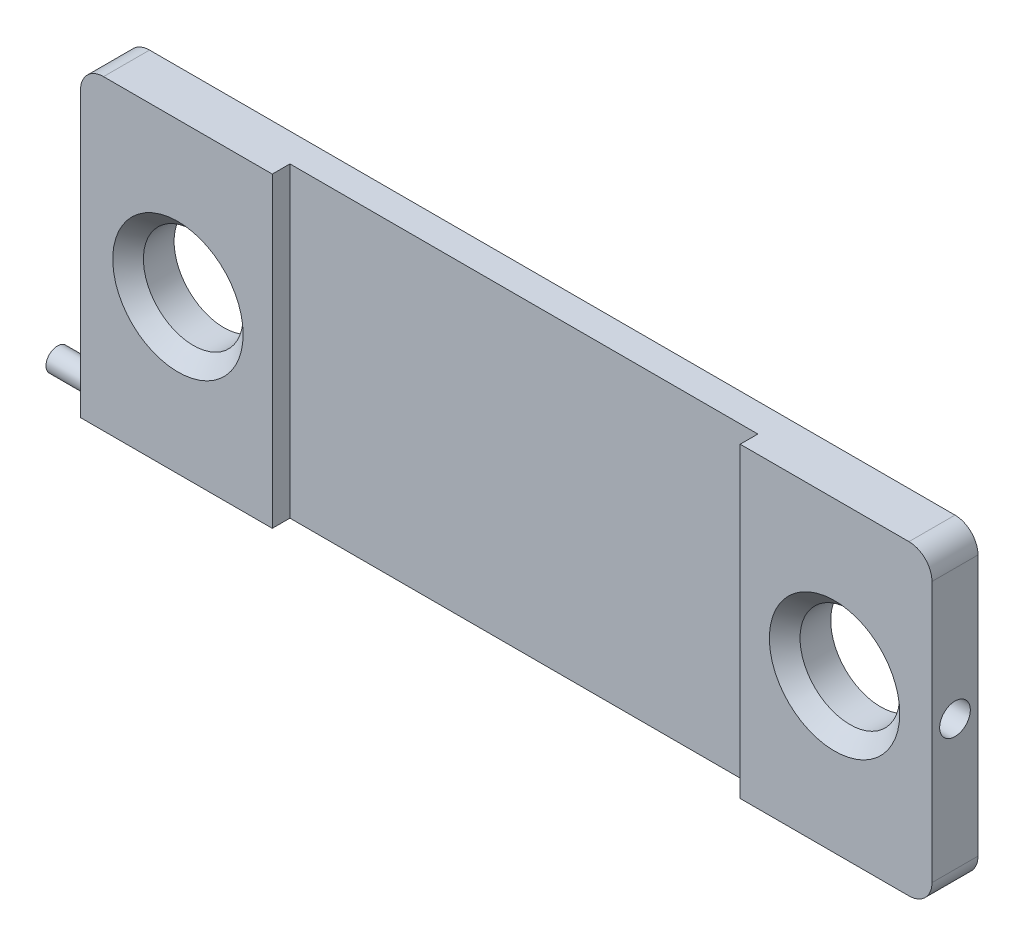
ISO-10303-21;
HEADER;
FILE_DESCRIPTION(('STEP AP214'),'2;1');
FILE_NAME('part.step','',(''),(''),'','','');
FILE_SCHEMA(('AUTOMOTIVE_DESIGN { 1 0 10303 214 1 1 1 1 }'));
ENDSEC;
DATA;
#1=APPLICATION_CONTEXT('core data for automotive mechanical design processes');
#2=APPLICATION_PROTOCOL_DEFINITION('international standard','automotive_design',2000,#1);
#3=PRODUCT_CONTEXT('',#1,'mechanical');
#4=PRODUCT('Part','Part','',(#3));
#5=PRODUCT_RELATED_PRODUCT_CATEGORY('part','',(#4));
#6=PRODUCT_DEFINITION_FORMATION('','',#4);
#7=PRODUCT_DEFINITION_CONTEXT('part definition',#1,'design');
#8=PRODUCT_DEFINITION('design','',#6,#7);
#9=PRODUCT_DEFINITION_SHAPE('','',#8);
#10=(LENGTH_UNIT() NAMED_UNIT(*) SI_UNIT(.MILLI.,.METRE.));
#11=(NAMED_UNIT(*) PLANE_ANGLE_UNIT() SI_UNIT($,.RADIAN.));
#12=(NAMED_UNIT(*) SI_UNIT($,.STERADIAN.) SOLID_ANGLE_UNIT());
#13=UNCERTAINTY_MEASURE_WITH_UNIT(LENGTH_MEASURE(1.E-05),#10,'distance_accuracy_value','');
#14=(GEOMETRIC_REPRESENTATION_CONTEXT(3) GLOBAL_UNCERTAINTY_ASSIGNED_CONTEXT((#13)) GLOBAL_UNIT_ASSIGNED_CONTEXT((#10,
#11,#12)) REPRESENTATION_CONTEXT('',''));
#15=CARTESIAN_POINT('',(0.,0.,0.));
#16=DIRECTION('',(0.,0.,1.));
#17=DIRECTION('',(1.,0.,0.));
#18=AXIS2_PLACEMENT_3D('',#15,#16,#17);
#19=CARTESIAN_POINT('',(-55.5,0.,3.));
#20=DIRECTION('',(1.,0.,0.));
#21=DIRECTION('',(0.,1.,0.));
#22=AXIS2_PLACEMENT_3D('',#19,#20,#21);
#23=PLANE('',#22);
#24=CARTESIAN_POINT('',(-55.5,-17.9,0.));
#25=DIRECTION('',(1.,0.,0.));
#26=DIRECTION('',(0.,1.,0.));
#27=AXIS2_PLACEMENT_3D('',#24,#25,#26);
#28=CIRCLE('',#27,1.5);
#29=CARTESIAN_POINT('',(-55.5,-16.4,0.));
#30=VERTEX_POINT('',#29);
#31=EDGE_CURVE('E12',#30,#30,#28,.F.);
#32=ORIENTED_EDGE('',*,*,#31,.F.);
#33=EDGE_LOOP('',(#32));
#34=FACE_BOUND('',#33,.T.);
#35=DIRECTION('',(0.,-1.,0.));
#36=VECTOR('',#35,1.);
#37=CARTESIAN_POINT('',(-55.5,0.,3.));
#38=LINE('',#37,#36);
#39=CARTESIAN_POINT('',(-55.5,17.,3.));
#40=VERTEX_POINT('',#39);
#41=CARTESIAN_POINT('',(-55.5,-20.,3.));
#42=VERTEX_POINT('',#41);
#43=EDGE_CURVE('E201',#40,#42,#38,.T.);
#44=ORIENTED_EDGE('',*,*,#43,.F.);
#45=DIRECTION('',(0.,0.,-1.));
#46=VECTOR('',#45,1.);
#47=CARTESIAN_POINT('',(-55.5,17.,-3.));
#48=LINE('',#47,#46);
#49=CARTESIAN_POINT('',(-55.5,17.,-3.));
#50=VERTEX_POINT('',#49);
#51=EDGE_CURVE('E250',#40,#50,#48,.T.);
#52=ORIENTED_EDGE('',*,*,#51,.T.);
#53=DIRECTION('',(0.,-1.,0.));
#54=VECTOR('',#53,1.);
#55=CARTESIAN_POINT('',(-55.5,0.,-3.));
#56=LINE('',#55,#54);
#57=CARTESIAN_POINT('',(-55.5,-20.,-3.));
#58=VERTEX_POINT('',#57);
#59=EDGE_CURVE('E219',#50,#58,#56,.T.);
#60=ORIENTED_EDGE('',*,*,#59,.T.);
#61=DIRECTION('',(0.,0.,-1.));
#62=VECTOR('',#61,1.);
#63=CARTESIAN_POINT('',(-55.5,-20.,3.));
#64=LINE('',#63,#62);
#65=EDGE_CURVE('E207',#42,#58,#64,.T.);
#66=ORIENTED_EDGE('',*,*,#65,.F.);
#67=EDGE_LOOP('',(#44,#52,#60,#66));
#68=FACE_BOUND('',#67,.T.);
#69=CARTESIAN_POINT('',(-55.5,0.,0.));
#70=DIRECTION('',(-1.,0.,0.));
#71=DIRECTION('',(0.,0.,1.));
#72=AXIS2_PLACEMENT_3D('',#69,#70,#71);
#73=CIRCLE('',#72,2.);
#74=CARTESIAN_POINT('',(-55.5,0.,2.));
#75=VERTEX_POINT('',#74);
#76=EDGE_CURVE('E164',#75,#75,#73,.T.);
#77=ORIENTED_EDGE('',*,*,#76,.F.);
#78=EDGE_LOOP('',(#77));
#79=FACE_BOUND('',#78,.T.);
#80=ADVANCED_FACE('F46',(#34,#68,#79),#23,.F.);
#81=CARTESIAN_POINT('',(0.,0.,3.));
#82=DIRECTION('',(0.,0.,1.));
#83=DIRECTION('',(1.,0.,0.));
#84=AXIS2_PLACEMENT_3D('',#81,#82,#83);
#85=PLANE('',#84);
#86=DIRECTION('',(0.,-1.,0.));
#87=VECTOR('',#86,1.);
#88=CARTESIAN_POINT('',(-30.5,20.,3.));
#89=LINE('',#88,#87);
#90=CARTESIAN_POINT('',(-30.5,20.,3.));
#91=VERTEX_POINT('',#90);
#92=CARTESIAN_POINT('',(-30.5,-20.,3.));
#93=VERTEX_POINT('',#92);
#94=EDGE_CURVE('E167',#91,#93,#89,.T.);
#95=ORIENTED_EDGE('',*,*,#94,.F.);
#96=DIRECTION('',(1.,0.,0.));
#97=VECTOR('',#96,1.);
#98=CARTESIAN_POINT('',(0.,20.,3.));
#99=LINE('',#98,#97);
#100=CARTESIAN_POINT('',(-52.5,20.,3.));
#101=VERTEX_POINT('',#100);
#102=EDGE_CURVE('E198',#101,#91,#99,.T.);
#103=ORIENTED_EDGE('',*,*,#102,.F.);
#104=CARTESIAN_POINT('',(-52.5,17.,3.));
#105=DIRECTION('',(0.,0.,1.));
#106=DIRECTION('',(1.,0.,0.));
#107=AXIS2_PLACEMENT_3D('',#104,#105,#106);
#108=CIRCLE('',#107,3.);
#109=EDGE_CURVE('E70',#101,#40,#108,.T.);
#110=ORIENTED_EDGE('',*,*,#109,.T.);
#111=ORIENTED_EDGE('',*,*,#43,.T.);
#112=DIRECTION('',(1.,0.,0.));
#113=VECTOR('',#112,1.);
#114=CARTESIAN_POINT('',(0.,-20.,3.));
#115=LINE('',#114,#113);
#116=EDGE_CURVE('E204',#42,#93,#115,.T.);
#117=ORIENTED_EDGE('',*,*,#116,.T.);
#118=EDGE_LOOP('',(#95,#103,#110,#111,#117));
#119=FACE_BOUND('',#118,.T.);
#120=CARTESIAN_POINT('',(-42.8,0.,3.));
#121=DIRECTION('',(0.,0.,1.));
#122=DIRECTION('',(1.,0.,0.));
#123=AXIS2_PLACEMENT_3D('',#120,#121,#122);
#124=CIRCLE('',#123,8.49999999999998);
#125=CARTESIAN_POINT('',(-34.3,0.,3.));
#126=VERTEX_POINT('',#125);
#127=EDGE_CURVE('E256',#126,#126,#124,.F.);
#128=ORIENTED_EDGE('',*,*,#127,.T.);
#129=EDGE_LOOP('',(#128));
#130=FACE_BOUND('',#129,.T.);
#131=ADVANCED_FACE('F294',(#119,#130),#85,.T.);
#132=CARTESIAN_POINT('',(55.5,0.,3.));
#133=DIRECTION('',(1.,0.,0.));
#134=DIRECTION('',(0.,1.,0.));
#135=AXIS2_PLACEMENT_3D('',#132,#133,#134);
#136=PLANE('',#135);
#137=CARTESIAN_POINT('',(55.5,0.,0.));
#138=DIRECTION('',(1.,0.,0.));
#139=DIRECTION('',(0.,0.,-1.));
#140=AXIS2_PLACEMENT_3D('',#137,#138,#139);
#141=CIRCLE('',#140,2.);
#142=CARTESIAN_POINT('',(55.5,0.,-2.));
#143=VERTEX_POINT('',#142);
#144=EDGE_CURVE('E153',#143,#143,#141,.T.);
#145=ORIENTED_EDGE('',*,*,#144,.F.);
#146=EDGE_LOOP('',(#145));
#147=FACE_BOUND('',#146,.T.);
#148=DIRECTION('',(0.,-1.,0.));
#149=VECTOR('',#148,1.);
#150=CARTESIAN_POINT('',(55.5,0.,3.));
#151=LINE('',#150,#149);
#152=CARTESIAN_POINT('',(55.5,17.,3.));
#153=VERTEX_POINT('',#152);
#154=CARTESIAN_POINT('',(55.5,-17.,3.));
#155=VERTEX_POINT('',#154);
#156=EDGE_CURVE('E193',#153,#155,#151,.T.);
#157=ORIENTED_EDGE('',*,*,#156,.T.);
#158=DIRECTION('',(0.,0.,-1.));
#159=VECTOR('',#158,1.);
#160=CARTESIAN_POINT('',(55.5,-17.,-3.));
#161=LINE('',#160,#159);
#162=CARTESIAN_POINT('',(55.5,-17.,-3.));
#163=VERTEX_POINT('',#162);
#164=EDGE_CURVE('E227',#155,#163,#161,.T.);
#165=ORIENTED_EDGE('',*,*,#164,.T.);
#166=DIRECTION('',(0.,-1.,0.));
#167=VECTOR('',#166,1.);
#168=CARTESIAN_POINT('',(55.5,0.,-3.));
#169=LINE('',#168,#167);
#170=CARTESIAN_POINT('',(55.5,17.,-3.));
#171=VERTEX_POINT('',#170);
#172=EDGE_CURVE('E213',#171,#163,#169,.T.);
#173=ORIENTED_EDGE('',*,*,#172,.F.);
#174=DIRECTION('',(0.,0.,-1.));
#175=VECTOR('',#174,1.);
#176=CARTESIAN_POINT('',(55.5,17.,3.));
#177=LINE('',#176,#175);
#178=EDGE_CURVE('E225',#171,#153,#177,.F.);
#179=ORIENTED_EDGE('',*,*,#178,.T.);
#180=EDGE_LOOP('',(#157,#165,#173,#179));
#181=FACE_BOUND('',#180,.T.);
#182=ADVANCED_FACE('F300',(#147,#181),#136,.T.);
#183=CARTESIAN_POINT('',(0.,20.,3.));
#184=DIRECTION('',(0.,1.,0.));
#185=DIRECTION('',(0.,0.,1.));
#186=AXIS2_PLACEMENT_3D('',#183,#184,#185);
#187=PLANE('',#186);
#188=DIRECTION('',(0.,0.,1.));
#189=VECTOR('',#188,1.);
#190=CARTESIAN_POINT('',(-30.5,20.,0.7));
#191=LINE('',#190,#189);
#192=CARTESIAN_POINT('',(-30.5,20.,0.7));
#193=VERTEX_POINT('',#192);
#194=EDGE_CURVE('E184',#193,#91,#191,.T.);
#195=ORIENTED_EDGE('',*,*,#194,.F.);
#196=DIRECTION('',(-1.,0.,0.));
#197=VECTOR('',#196,1.);
#198=CARTESIAN_POINT('',(-30.5,20.,0.7));
#199=LINE('',#198,#197);
#200=CARTESIAN_POINT('',(30.5,20.,0.7));
#201=VERTEX_POINT('',#200);
#202=EDGE_CURVE('E178',#201,#193,#199,.T.);
#203=ORIENTED_EDGE('',*,*,#202,.F.);
#204=DIRECTION('',(0.,0.,1.));
#205=VECTOR('',#204,1.);
#206=CARTESIAN_POINT('',(30.5,20.,0.7));
#207=LINE('',#206,#205);
#208=CARTESIAN_POINT('',(30.5,20.,3.));
#209=VERTEX_POINT('',#208);
#210=EDGE_CURVE('E187',#201,#209,#207,.T.);
#211=ORIENTED_EDGE('',*,*,#210,.T.);
#212=CARTESIAN_POINT('',(52.5,20.,3.));
#213=VERTEX_POINT('',#212);
#214=EDGE_CURVE('E196',#209,#213,#99,.T.);
#215=ORIENTED_EDGE('',*,*,#214,.T.);
#216=DIRECTION('',(0.,0.,-1.));
#217=VECTOR('',#216,1.);
#218=CARTESIAN_POINT('',(52.5,20.,3.));
#219=LINE('',#218,#217);
#220=CARTESIAN_POINT('',(52.5,20.,-3.));
#221=VERTEX_POINT('',#220);
#222=EDGE_CURVE('E247',#213,#221,#219,.T.);
#223=ORIENTED_EDGE('',*,*,#222,.T.);
#224=DIRECTION('',(1.,0.,0.));
#225=VECTOR('',#224,1.);
#226=CARTESIAN_POINT('',(0.,20.,-3.));
#227=LINE('',#226,#225);
#228=CARTESIAN_POINT('',(-52.5,20.,-3.));
#229=VERTEX_POINT('',#228);
#230=EDGE_CURVE('E216',#229,#221,#227,.T.);
#231=ORIENTED_EDGE('',*,*,#230,.F.);
#232=DIRECTION('',(0.,0.,-1.));
#233=VECTOR('',#232,1.);
#234=CARTESIAN_POINT('',(-52.5,20.,3.));
#235=LINE('',#234,#233);
#236=EDGE_CURVE('E245',#229,#101,#235,.F.);
#237=ORIENTED_EDGE('',*,*,#236,.T.);
#238=ORIENTED_EDGE('',*,*,#102,.T.);
#239=EDGE_LOOP('',(#195,#203,#211,#215,#223,#231,#237,#238));
#240=FACE_BOUND('',#239,.T.);
#241=ADVANCED_FACE('F309',(#240),#187,.T.);
#242=CARTESIAN_POINT('',(-42.8,0.,3.));
#243=DIRECTION('',(0.,0.,-1.));
#244=DIRECTION('',(-1.,0.,0.));
#245=AXIS2_PLACEMENT_3D('',#242,#243,#244);
#246=CYLINDRICAL_SURFACE('',#245,6.5);
#247=CARTESIAN_POINT('',(-42.8,0.,1.00000000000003));
#248=DIRECTION('',(0.,0.,1.));
#249=DIRECTION('',(1.,0.,0.));
#250=AXIS2_PLACEMENT_3D('',#247,#248,#249);
#251=CIRCLE('',#250,6.5);
#252=CARTESIAN_POINT('',(-36.3,0.,1.00000000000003));
#253=VERTEX_POINT('',#252);
#254=EDGE_CURVE('E262',#253,#253,#251,.T.);
#255=ORIENTED_EDGE('',*,*,#254,.T.);
#256=EDGE_LOOP('',(#255));
#257=FACE_BOUND('',#256,.T.);
#258=CARTESIAN_POINT('',(-42.8,0.,-3.));
#259=DIRECTION('',(0.,0.,1.));
#260=DIRECTION('',(1.,0.,0.));
#261=AXIS2_PLACEMENT_3D('',#258,#259,#260);
#262=CIRCLE('',#261,6.5);
#263=CARTESIAN_POINT('',(-36.3,0.,-3.));
#264=VERTEX_POINT('',#263);
#265=EDGE_CURVE('E210',#264,#264,#262,.T.);
#266=ORIENTED_EDGE('',*,*,#265,.F.);
#267=EDGE_LOOP('',(#266));
#268=FACE_BOUND('',#267,.T.);
#269=ADVANCED_FACE('F312',(#257,#268),#246,.F.);
#270=CARTESIAN_POINT('',(42.8,0.,3.));
#271=DIRECTION('',(0.,0.,-1.));
#272=DIRECTION('',(-1.,0.,0.));
#273=AXIS2_PLACEMENT_3D('',#270,#271,#272);
#274=CYLINDRICAL_SURFACE('',#273,6.5);
#275=CARTESIAN_POINT('',(42.8,0.,0.999999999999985));
#276=DIRECTION('',(0.,0.,1.));
#277=DIRECTION('',(1.,0.,0.));
#278=AXIS2_PLACEMENT_3D('',#275,#276,#277);
#279=CIRCLE('',#278,6.5);
#280=CARTESIAN_POINT('',(49.3,0.,0.999999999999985));
#281=VERTEX_POINT('',#280);
#282=EDGE_CURVE('E253',#281,#281,#279,.T.);
#283=ORIENTED_EDGE('',*,*,#282,.T.);
#284=EDGE_LOOP('',(#283));
#285=FACE_BOUND('',#284,.T.);
#286=CARTESIAN_POINT('',(42.8,0.,-3.));
#287=DIRECTION('',(0.,0.,1.));
#288=DIRECTION('',(1.,0.,0.));
#289=AXIS2_PLACEMENT_3D('',#286,#287,#288);
#290=CIRCLE('',#289,6.5);
#291=CARTESIAN_POINT('',(49.3,0.,-3.));
#292=VERTEX_POINT('',#291);
#293=EDGE_CURVE('E186',#292,#292,#290,.T.);
#294=ORIENTED_EDGE('',*,*,#293,.F.);
#295=EDGE_LOOP('',(#294));
#296=FACE_BOUND('',#295,.T.);
#297=ADVANCED_FACE('F319',(#285,#296),#274,.F.);
#298=CARTESIAN_POINT('',(0.,-20.,3.));
#299=DIRECTION('',(0.,1.,0.));
#300=DIRECTION('',(-1.,0.,0.));
#301=AXIS2_PLACEMENT_3D('',#298,#299,#300);
#302=PLANE('',#301);
#303=DIRECTION('',(1.,0.,0.));
#304=VECTOR('',#303,1.);
#305=CARTESIAN_POINT('',(-30.5,-20.,0.7));
#306=LINE('',#305,#304);
#307=CARTESIAN_POINT('',(-30.5,-20.,0.7));
#308=VERTEX_POINT('',#307);
#309=CARTESIAN_POINT('',(30.5,-20.,0.7));
#310=VERTEX_POINT('',#309);
#311=EDGE_CURVE('E171',#308,#310,#306,.T.);
#312=ORIENTED_EDGE('',*,*,#311,.F.);
#313=DIRECTION('',(0.,0.,1.));
#314=VECTOR('',#313,1.);
#315=CARTESIAN_POINT('',(-30.5,-20.,0.7));
#316=LINE('',#315,#314);
#317=EDGE_CURVE('E181',#308,#93,#316,.T.);
#318=ORIENTED_EDGE('',*,*,#317,.T.);
#319=ORIENTED_EDGE('',*,*,#116,.F.);
#320=ORIENTED_EDGE('',*,*,#65,.T.);
#321=DIRECTION('',(1.,0.,0.));
#322=VECTOR('',#321,1.);
#323=CARTESIAN_POINT('',(0.,-20.,-3.));
#324=LINE('',#323,#322);
#325=CARTESIAN_POINT('',(52.5,-20.,-3.));
#326=VERTEX_POINT('',#325);
#327=EDGE_CURVE('E197',#58,#326,#324,.T.);
#328=ORIENTED_EDGE('',*,*,#327,.T.);
#329=DIRECTION('',(0.,0.,-1.));
#330=VECTOR('',#329,1.);
#331=CARTESIAN_POINT('',(52.5,-20.,3.));
#332=LINE('',#331,#330);
#333=CARTESIAN_POINT('',(52.5,-20.,3.));
#334=VERTEX_POINT('',#333);
#335=EDGE_CURVE('E236',#326,#334,#332,.F.);
#336=ORIENTED_EDGE('',*,*,#335,.T.);
#337=CARTESIAN_POINT('',(30.5,-20.,3.));
#338=VERTEX_POINT('',#337);
#339=EDGE_CURVE('E203',#338,#334,#115,.T.);
#340=ORIENTED_EDGE('',*,*,#339,.F.);
#341=DIRECTION('',(0.,0.,1.));
#342=VECTOR('',#341,1.);
#343=CARTESIAN_POINT('',(30.5,-20.,0.7));
#344=LINE('',#343,#342);
#345=EDGE_CURVE('E62',#310,#338,#344,.T.);
#346=ORIENTED_EDGE('',*,*,#345,.F.);
#347=EDGE_LOOP('',(#312,#318,#319,#320,#328,#336,#340,#346));
#348=FACE_BOUND('',#347,.T.);
#349=ADVANCED_FACE('F307',(#348),#302,.F.);
#350=DIRECTION('',(0.,1.,0.));
#351=VECTOR('',#350,1.);
#352=CARTESIAN_POINT('',(30.5,20.,3.));
#353=LINE('',#352,#351);
#354=EDGE_CURVE('E172',#338,#209,#353,.T.);
#355=ORIENTED_EDGE('',*,*,#354,.F.);
#356=ORIENTED_EDGE('',*,*,#339,.T.);
#357=CARTESIAN_POINT('',(52.5,-17.,3.));
#358=DIRECTION('',(0.,0.,1.));
#359=DIRECTION('',(1.,0.,0.));
#360=AXIS2_PLACEMENT_3D('',#357,#358,#359);
#361=CIRCLE('',#360,3.);
#362=EDGE_CURVE('E243',#334,#155,#361,.T.);
#363=ORIENTED_EDGE('',*,*,#362,.T.);
#364=ORIENTED_EDGE('',*,*,#156,.F.);
#365=CARTESIAN_POINT('',(52.5,17.,3.));
#366=DIRECTION('',(0.,0.,1.));
#367=DIRECTION('',(1.,0.,0.));
#368=AXIS2_PLACEMENT_3D('',#365,#366,#367);
#369=CIRCLE('',#368,3.);
#370=EDGE_CURVE('E240',#153,#213,#369,.T.);
#371=ORIENTED_EDGE('',*,*,#370,.T.);
#372=ORIENTED_EDGE('',*,*,#214,.F.);
#373=EDGE_LOOP('',(#355,#356,#363,#364,#371,#372));
#374=FACE_BOUND('',#373,.T.);
#375=CARTESIAN_POINT('',(42.8,0.,3.));
#376=DIRECTION('',(0.,0.,1.));
#377=DIRECTION('',(1.,0.,0.));
#378=AXIS2_PLACEMENT_3D('',#375,#376,#377);
#379=CIRCLE('',#378,8.50000000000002);
#380=CARTESIAN_POINT('',(51.3,0.,3.));
#381=VERTEX_POINT('',#380);
#382=EDGE_CURVE('E259',#381,#381,#379,.F.);
#383=ORIENTED_EDGE('',*,*,#382,.T.);
#384=EDGE_LOOP('',(#383));
#385=FACE_BOUND('',#384,.T.);
#386=ADVANCED_FACE('F302',(#374,#385),#85,.T.);
#387=CARTESIAN_POINT('',(0.,0.,-3.));
#388=DIRECTION('',(0.,0.,1.));
#389=DIRECTION('',(1.,0.,0.));
#390=AXIS2_PLACEMENT_3D('',#387,#388,#389);
#391=PLANE('',#390);
#392=ORIENTED_EDGE('',*,*,#293,.T.);
#393=EDGE_LOOP('',(#392));
#394=FACE_BOUND('',#393,.T.);
#395=ORIENTED_EDGE('',*,*,#265,.T.);
#396=EDGE_LOOP('',(#395));
#397=FACE_BOUND('',#396,.T.);
#398=ORIENTED_EDGE('',*,*,#172,.T.);
#399=CARTESIAN_POINT('',(52.5,-17.,-3.));
#400=DIRECTION('',(0.,0.,1.));
#401=DIRECTION('',(1.,0.,0.));
#402=AXIS2_PLACEMENT_3D('',#399,#400,#401);
#403=CIRCLE('',#402,3.);
#404=EDGE_CURVE('E234',#163,#326,#403,.F.);
#405=ORIENTED_EDGE('',*,*,#404,.T.);
#406=ORIENTED_EDGE('',*,*,#327,.F.);
#407=ORIENTED_EDGE('',*,*,#59,.F.);
#408=CARTESIAN_POINT('',(-52.5,17.,-3.));
#409=DIRECTION('',(0.,0.,1.));
#410=DIRECTION('',(1.,0.,0.));
#411=AXIS2_PLACEMENT_3D('',#408,#409,#410);
#412=CIRCLE('',#411,3.);
#413=EDGE_CURVE('E230',#50,#229,#412,.F.);
#414=ORIENTED_EDGE('',*,*,#413,.T.);
#415=ORIENTED_EDGE('',*,*,#230,.T.);
#416=CARTESIAN_POINT('',(52.5,17.,-3.));
#417=DIRECTION('',(0.,0.,1.));
#418=DIRECTION('',(1.,0.,0.));
#419=AXIS2_PLACEMENT_3D('',#416,#417,#418);
#420=CIRCLE('',#419,3.);
#421=EDGE_CURVE('E232',#221,#171,#420,.F.);
#422=ORIENTED_EDGE('',*,*,#421,.T.);
#423=EDGE_LOOP('',(#398,#405,#406,#407,#414,#415,#422));
#424=FACE_BOUND('',#423,.T.);
#425=ADVANCED_FACE('F328',(#394,#397,#424),#391,.F.);
#426=CARTESIAN_POINT('',(52.5,-17.,3.));
#427=DIRECTION('',(0.,0.,1.));
#428=DIRECTION('',(1.,0.,0.));
#429=AXIS2_PLACEMENT_3D('',#426,#427,#428);
#430=CYLINDRICAL_SURFACE('',#429,3.);
#431=ORIENTED_EDGE('',*,*,#362,.F.);
#432=ORIENTED_EDGE('',*,*,#335,.F.);
#433=ORIENTED_EDGE('',*,*,#404,.F.);
#434=ORIENTED_EDGE('',*,*,#164,.F.);
#435=EDGE_LOOP('',(#431,#432,#433,#434));
#436=FACE_BOUND('',#435,.T.);
#437=ADVANCED_FACE('F324',(#436),#430,.T.);
#438=CARTESIAN_POINT('',(52.5,17.,3.));
#439=DIRECTION('',(0.,0.,-1.));
#440=DIRECTION('',(-1.,0.,0.));
#441=AXIS2_PLACEMENT_3D('',#438,#439,#440);
#442=CYLINDRICAL_SURFACE('',#441,3.);
#443=ORIENTED_EDGE('',*,*,#370,.F.);
#444=ORIENTED_EDGE('',*,*,#178,.F.);
#445=ORIENTED_EDGE('',*,*,#421,.F.);
#446=ORIENTED_EDGE('',*,*,#222,.F.);
#447=EDGE_LOOP('',(#443,#444,#445,#446));
#448=FACE_BOUND('',#447,.T.);
#449=ADVANCED_FACE('F327',(#448),#442,.T.);
#450=CARTESIAN_POINT('',(-52.5,17.,3.));
#451=DIRECTION('',(0.,0.,1.));
#452=DIRECTION('',(1.,0.,0.));
#453=AXIS2_PLACEMENT_3D('',#450,#451,#452);
#454=CYLINDRICAL_SURFACE('',#453,3.);
#455=ORIENTED_EDGE('',*,*,#109,.F.);
#456=ORIENTED_EDGE('',*,*,#236,.F.);
#457=ORIENTED_EDGE('',*,*,#413,.F.);
#458=ORIENTED_EDGE('',*,*,#51,.F.);
#459=EDGE_LOOP('',(#455,#456,#457,#458));
#460=FACE_BOUND('',#459,.T.);
#461=ADVANCED_FACE('F332',(#460),#454,.T.);
#462=CARTESIAN_POINT('',(42.8,0.,0.999999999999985));
#463=DIRECTION('',(0.,0.,1.));
#464=DIRECTION('',(1.,0.,0.));
#465=AXIS2_PLACEMENT_3D('',#462,#463,#464);
#466=CONICAL_SURFACE('',#465,6.5,0.78539816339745);
#467=ORIENTED_EDGE('',*,*,#382,.F.);
#468=EDGE_LOOP('',(#467));
#469=FACE_BOUND('',#468,.T.);
#470=ORIENTED_EDGE('',*,*,#282,.F.);
#471=EDGE_LOOP('',(#470));
#472=FACE_BOUND('',#471,.T.);
#473=ADVANCED_FACE('F335',(#469,#472),#466,.F.);
#474=CARTESIAN_POINT('',(-42.8,0.,1.00000000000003));
#475=DIRECTION('',(0.,0.,1.));
#476=DIRECTION('',(1.,0.,0.));
#477=AXIS2_PLACEMENT_3D('',#474,#475,#476);
#478=CONICAL_SURFACE('',#477,6.5,0.78539816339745);
#479=ORIENTED_EDGE('',*,*,#127,.F.);
#480=EDGE_LOOP('',(#479));
#481=FACE_BOUND('',#480,.T.);
#482=ORIENTED_EDGE('',*,*,#254,.F.);
#483=EDGE_LOOP('',(#482));
#484=FACE_BOUND('',#483,.T.);
#485=ADVANCED_FACE('F48',(#481,#484),#478,.F.);
#486=CARTESIAN_POINT('',(-30.5,20.,0.7));
#487=DIRECTION('',(-1.,0.,0.));
#488=DIRECTION('',(0.,-1.,0.));
#489=AXIS2_PLACEMENT_3D('',#486,#487,#488);
#490=PLANE('',#489);
#491=ORIENTED_EDGE('',*,*,#94,.T.);
#492=ORIENTED_EDGE('',*,*,#317,.F.);
#493=DIRECTION('',(0.,-1.,0.));
#494=VECTOR('',#493,1.);
#495=CARTESIAN_POINT('',(-30.5,20.,0.7));
#496=LINE('',#495,#494);
#497=EDGE_CURVE('E168',#193,#308,#496,.T.);
#498=ORIENTED_EDGE('',*,*,#497,.F.);
#499=ORIENTED_EDGE('',*,*,#194,.T.);
#500=EDGE_LOOP('',(#491,#492,#498,#499));
#501=FACE_BOUND('',#500,.T.);
#502=ADVANCED_FACE('F342',(#501),#490,.F.);
#503=CARTESIAN_POINT('',(30.5,20.,0.7));
#504=DIRECTION('',(1.,0.,0.));
#505=DIRECTION('',(0.,0.,-1.));
#506=AXIS2_PLACEMENT_3D('',#503,#504,#505);
#507=PLANE('',#506);
#508=ORIENTED_EDGE('',*,*,#354,.T.);
#509=ORIENTED_EDGE('',*,*,#210,.F.);
#510=DIRECTION('',(0.,1.,0.));
#511=VECTOR('',#510,1.);
#512=CARTESIAN_POINT('',(30.5,20.,0.7));
#513=LINE('',#512,#511);
#514=EDGE_CURVE('E175',#310,#201,#513,.T.);
#515=ORIENTED_EDGE('',*,*,#514,.F.);
#516=ORIENTED_EDGE('',*,*,#345,.T.);
#517=EDGE_LOOP('',(#508,#509,#515,#516));
#518=FACE_BOUND('',#517,.T.);
#519=ADVANCED_FACE('F384',(#518),#507,.F.);
#520=CARTESIAN_POINT('',(-30.5,-20.,0.7));
#521=DIRECTION('',(0.,0.,1.));
#522=DIRECTION('',(1.,0.,0.));
#523=AXIS2_PLACEMENT_3D('',#520,#521,#522);
#524=PLANE('',#523);
#525=ORIENTED_EDGE('',*,*,#497,.T.);
#526=ORIENTED_EDGE('',*,*,#311,.T.);
#527=ORIENTED_EDGE('',*,*,#514,.T.);
#528=ORIENTED_EDGE('',*,*,#202,.T.);
#529=EDGE_LOOP('',(#525,#526,#527,#528));
#530=FACE_BOUND('',#529,.T.);
#531=ADVANCED_FACE('F382',(#530),#524,.T.);
#532=CARTESIAN_POINT('',(-55.5,0.,0.));
#533=DIRECTION('',(-1.,0.,0.));
#534=DIRECTION('',(0.,0.,1.));
#535=AXIS2_PLACEMENT_3D('',#532,#533,#534);
#536=CYLINDRICAL_SURFACE('',#535,2.);
#537=CARTESIAN_POINT('',(-51.8,0.,0.));
#538=DIRECTION('',(-1.,0.,0.));
#539=DIRECTION('',(0.,0.,1.));
#540=AXIS2_PLACEMENT_3D('',#537,#538,#539);
#541=CIRCLE('',#540,2.);
#542=CARTESIAN_POINT('',(-51.8,0.,2.));
#543=VERTEX_POINT('',#542);
#544=EDGE_CURVE('E161',#543,#543,#541,.T.);
#545=ORIENTED_EDGE('',*,*,#544,.F.);
#546=EDGE_LOOP('',(#545));
#547=FACE_BOUND('',#546,.T.);
#548=ORIENTED_EDGE('',*,*,#76,.T.);
#549=EDGE_LOOP('',(#548));
#550=FACE_BOUND('',#549,.T.);
#551=ADVANCED_FACE('F391',(#547,#550),#536,.F.);
#552=CARTESIAN_POINT('',(-51.8,0.,0.));
#553=DIRECTION('',(-1.,0.,0.));
#554=DIRECTION('',(0.,0.,1.));
#555=AXIS2_PLACEMENT_3D('',#552,#553,#554);
#556=CONICAL_SURFACE('',#555,2.,0.785398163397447);
#557=CARTESIAN_POINT('',(-49.8,0.,0.));
#558=VERTEX_POINT('',#557);
#559=VERTEX_LOOP('',#558);
#560=FACE_BOUND('',#559,.T.);
#561=ORIENTED_EDGE('',*,*,#544,.T.);
#562=EDGE_LOOP('',(#561));
#563=FACE_BOUND('',#562,.T.);
#564=ADVANCED_FACE('F492',(#560,#563),#556,.F.);
#565=CARTESIAN_POINT('',(55.5,0.,0.));
#566=DIRECTION('',(1.,0.,0.));
#567=DIRECTION('',(0.,0.,-1.));
#568=AXIS2_PLACEMENT_3D('',#565,#566,#567);
#569=CYLINDRICAL_SURFACE('',#568,2.);
#570=CARTESIAN_POINT('',(51.8,0.,0.));
#571=DIRECTION('',(1.,0.,0.));
#572=DIRECTION('',(0.,0.,-1.));
#573=AXIS2_PLACEMENT_3D('',#570,#571,#572);
#574=CIRCLE('',#573,2.);
#575=CARTESIAN_POINT('',(51.8,0.,-2.));
#576=VERTEX_POINT('',#575);
#577=EDGE_CURVE('E149',#576,#576,#574,.T.);
#578=ORIENTED_EDGE('',*,*,#577,.F.);
#579=EDGE_LOOP('',(#578));
#580=FACE_BOUND('',#579,.T.);
#581=ORIENTED_EDGE('',*,*,#144,.T.);
#582=EDGE_LOOP('',(#581));
#583=FACE_BOUND('',#582,.T.);
#584=ADVANCED_FACE('F289',(#580,#583),#569,.F.);
#585=CARTESIAN_POINT('',(51.8,0.,0.));
#586=DIRECTION('',(1.,0.,0.));
#587=DIRECTION('',(0.,0.,-1.));
#588=AXIS2_PLACEMENT_3D('',#585,#586,#587);
#589=CONICAL_SURFACE('',#588,2.,0.785398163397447);
#590=CARTESIAN_POINT('',(49.8,0.,0.));
#591=VERTEX_POINT('',#590);
#592=VERTEX_LOOP('',#591);
#593=FACE_BOUND('',#592,.T.);
#594=ORIENTED_EDGE('',*,*,#577,.T.);
#595=EDGE_LOOP('',(#594));
#596=FACE_BOUND('',#595,.T.);
#597=ADVANCED_FACE('F283',(#593,#596),#589,.F.);
#598=CARTESIAN_POINT('',(-61.5,-17.9,0.));
#599=DIRECTION('',(1.,0.,0.));
#600=DIRECTION('',(0.,1.,0.));
#601=AXIS2_PLACEMENT_3D('',#598,#599,#600);
#602=CYLINDRICAL_SURFACE('',#601,1.5);
#603=CARTESIAN_POINT('',(-61.5,-17.9,0.));
#604=DIRECTION('',(-1.,0.,0.));
#605=DIRECTION('',(0.,-1.,0.));
#606=AXIS2_PLACEMENT_3D('',#603,#604,#605);
#607=CIRCLE('',#606,1.5);
#608=CARTESIAN_POINT('',(-61.5,-19.4,0.));
#609=VERTEX_POINT('',#608);
#610=EDGE_CURVE('E150',#609,#609,#607,.T.);
#611=ORIENTED_EDGE('',*,*,#610,.F.);
#612=EDGE_LOOP('',(#611));
#613=FACE_BOUND('',#612,.T.);
#614=ORIENTED_EDGE('',*,*,#31,.T.);
#615=EDGE_LOOP('',(#614));
#616=FACE_BOUND('',#615,.T.);
#617=ADVANCED_FACE('F281',(#613,#616),#602,.T.);
#618=CARTESIAN_POINT('',(-61.5,-17.9,0.));
#619=DIRECTION('',(-1.,0.,0.));
#620=DIRECTION('',(0.,-1.,0.));
#621=AXIS2_PLACEMENT_3D('',#618,#619,#620);
#622=PLANE('',#621);
#623=ORIENTED_EDGE('',*,*,#610,.T.);
#624=EDGE_LOOP('',(#623));
#625=FACE_BOUND('',#624,.T.);
#626=ADVANCED_FACE('F280',(#625),#622,.T.);
#627=CLOSED_SHELL('',(#80,#131,#182,#241,#269,#297,#349,#386,#425,#437,#449,#461,#473,#485,#502,
#519,#531,#551,#564,#584,#597,#617,#626));
#628=CARTESIAN_POINT('',(-49.5,-17.9,0.));
#629=DIRECTION('',(-1.,0.,0.));
#630=DIRECTION('',(0.,-1.,0.));
#631=AXIS2_PLACEMENT_3D('',#628,#629,#630);
#632=PLANE('',#631);
#633=CARTESIAN_POINT('',(-49.5,-17.9,0.));
#634=DIRECTION('',(-1.,0.,0.));
#635=DIRECTION('',(0.,-1.,0.));
#636=AXIS2_PLACEMENT_3D('',#633,#634,#635);
#637=CIRCLE('',#636,1.25);
#638=CARTESIAN_POINT('',(-49.5,-19.15,0.));
#639=VERTEX_POINT('',#638);
#640=EDGE_CURVE('E55',#639,#639,#637,.F.);
#641=ORIENTED_EDGE('',*,*,#640,.T.);
#642=EDGE_LOOP('',(#641));
#643=FACE_BOUND('',#642,.T.);
#644=ADVANCED_FACE('F142',(#643),#632,.F.);
#645=CARTESIAN_POINT('',(-48.,-17.9,0.));
#646=DIRECTION('',(-1.,0.,0.));
#647=DIRECTION('',(0.,0.,1.));
#648=AXIS2_PLACEMENT_3D('',#645,#646,#647);
#649=CONICAL_SURFACE('',#648,1.25,1.02974425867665);
#650=CARTESIAN_POINT('',(-47.2489242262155,-17.9,0.));
#651=VERTEX_POINT('',#650);
#652=VERTEX_LOOP('',#651);
#653=FACE_BOUND('',#652,.T.);
#654=CARTESIAN_POINT('',(-48.,-17.9,0.));
#655=DIRECTION('',(-1.,0.,0.));
#656=DIRECTION('',(0.,0.,1.));
#657=AXIS2_PLACEMENT_3D('',#654,#655,#656);
#658=CIRCLE('',#657,1.25);
#659=CARTESIAN_POINT('',(-48.,-17.9,1.25));
#660=VERTEX_POINT('',#659);
#661=EDGE_CURVE('E147',#660,#660,#658,.T.);
#662=ORIENTED_EDGE('',*,*,#661,.T.);
#663=EDGE_LOOP('',(#662));
#664=FACE_BOUND('',#663,.T.);
#665=ADVANCED_FACE('F138',(#653,#664),#649,.F.);
#666=CARTESIAN_POINT('',(-55.5,-17.9,0.));
#667=DIRECTION('',(-1.,0.,0.));
#668=DIRECTION('',(0.,0.,1.));
#669=AXIS2_PLACEMENT_3D('',#666,#667,#668);
#670=CYLINDRICAL_SURFACE('',#669,1.25);
#671=ORIENTED_EDGE('',*,*,#661,.F.);
#672=EDGE_LOOP('',(#671));
#673=FACE_BOUND('',#672,.T.);
#674=ORIENTED_EDGE('',*,*,#640,.F.);
#675=EDGE_LOOP('',(#674));
#676=FACE_BOUND('',#675,.T.);
#677=ADVANCED_FACE('F141',(#673,#676),#670,.F.);
#678=CLOSED_SHELL('',(#644,#665,#677));
#679=ORIENTED_CLOSED_SHELL('',*,#678,.T.);
#680=BREP_WITH_VOIDS('B2',#627,(#679));
#681=ADVANCED_BREP_SHAPE_REPRESENTATION('',(#18,#680),#14);
#682=SHAPE_DEFINITION_REPRESENTATION(#9,#681);
ENDSEC;
END-ISO-10303-21;
